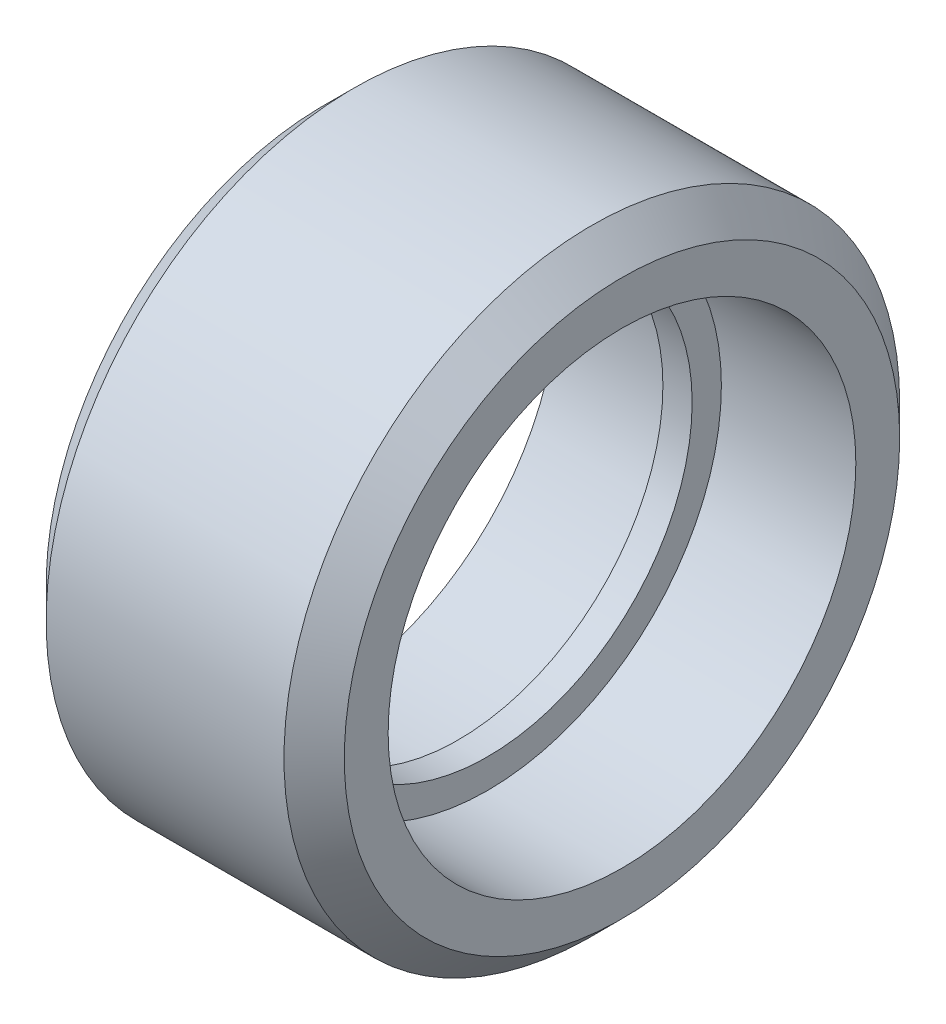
from build123d import *


with BuildPart() as part:
    # Sketch1 → Revolve1 (revolve)
    with BuildSketch(Plane.XY, mode=Mode.PRIVATE) as revolve1_sk:
        Polygon((0, 7), (-0.5, 7), (-0.5, 8), (-5.1, 8), (-5.1, 9.5), (-4.068629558, 10.531370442), (0, 10.531370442), align=None)
    revolve1 = revolve(revolve1_sk.sketch.rotate(Axis((0, 0, 0), (-1, 0, 0)), 90), axis=Axis((0, 0, 0), (-1, 0, 0)))

    # Mirror1: Revolve1 across plane
    add(revolve1.mirror(Plane(origin=(0, 10.531370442, 0), x_dir=(0, 0, 1), z_dir=(1, 0, 0))))


solid = part.part
